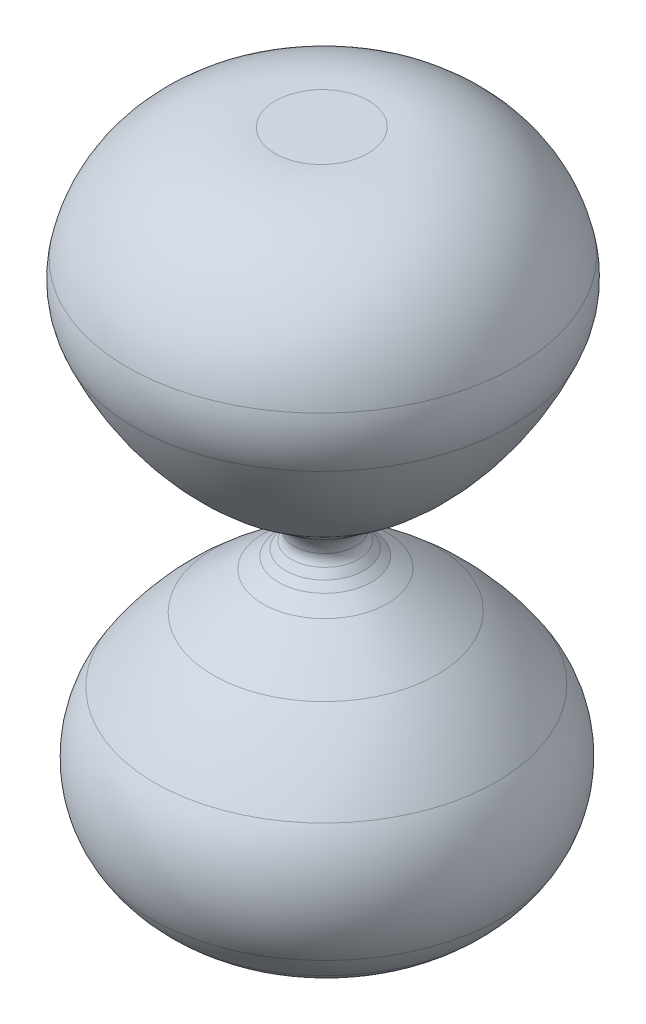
ISO-10303-21;
HEADER;
FILE_DESCRIPTION(('STEP AP214'),'2;1');
FILE_NAME('part.step','',(''),(''),'','','');
FILE_SCHEMA(('AUTOMOTIVE_DESIGN { 1 0 10303 214 1 1 1 1 }'));
ENDSEC;
DATA;
#1=APPLICATION_CONTEXT('core data for automotive mechanical design processes');
#2=APPLICATION_PROTOCOL_DEFINITION('international standard','automotive_design',2000,#1);
#3=PRODUCT_CONTEXT('',#1,'mechanical');
#4=PRODUCT('Part','Part','',(#3));
#5=PRODUCT_RELATED_PRODUCT_CATEGORY('part','',(#4));
#6=PRODUCT_DEFINITION_FORMATION('','',#4);
#7=PRODUCT_DEFINITION_CONTEXT('part definition',#1,'design');
#8=PRODUCT_DEFINITION('design','',#6,#7);
#9=PRODUCT_DEFINITION_SHAPE('','',#8);
#10=(LENGTH_UNIT() NAMED_UNIT(*) SI_UNIT(.MILLI.,.METRE.));
#11=(NAMED_UNIT(*) PLANE_ANGLE_UNIT() SI_UNIT($,.RADIAN.));
#12=(NAMED_UNIT(*) SI_UNIT($,.STERADIAN.) SOLID_ANGLE_UNIT());
#13=UNCERTAINTY_MEASURE_WITH_UNIT(LENGTH_MEASURE(1.E-05),#10,'distance_accuracy_value','');
#14=(GEOMETRIC_REPRESENTATION_CONTEXT(3) GLOBAL_UNCERTAINTY_ASSIGNED_CONTEXT((#13)) GLOBAL_UNIT_ASSIGNED_CONTEXT((#10,
#11,#12)) REPRESENTATION_CONTEXT('',''));
#15=CARTESIAN_POINT('',(0.,0.,0.));
#16=DIRECTION('',(0.,0.,1.));
#17=DIRECTION('',(1.,0.,0.));
#18=AXIS2_PLACEMENT_3D('',#15,#16,#17);
#19=CARTESIAN_POINT('',(0.254643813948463,94.7935693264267,0.));
#20=DIRECTION('',(-0.00939949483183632,0.999955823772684,0.));
#21=DIRECTION('',(-0.999955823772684,-0.00939949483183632,0.));
#22=AXIS2_PLACEMENT_3D('',#19,#20,#21);
#23=DEGENERATE_TOROIDAL_SURFACE('',#22,10.5104678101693,26.5079333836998,.T.);
#24=CARTESIAN_POINT('',(0.00604862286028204,121.24011922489,0.));
#25=DIRECTION('',(-0.00939949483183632,0.999955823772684,0.));
#26=DIRECTION('',(-0.999955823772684,-0.00939949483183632,0.));
#27=AXIS2_PLACEMENT_3D('',#24,#25,#26);
#28=CIRCLE('',#27,8.72476593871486);
#29=CARTESIAN_POINT('',(-8.71833188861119,121.15811083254,0.));
#30=VERTEX_POINT('',#29);
#31=EDGE_CURVE('E52',#30,#30,#28,.T.);
#32=ORIENTED_EDGE('',*,*,#31,.F.);
#33=EDGE_LOOP('',(#32));
#34=FACE_BOUND('',#33,.T.);
#35=CARTESIAN_POINT('',(0.203753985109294,100.207432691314,0.));
#36=DIRECTION('',(-0.00939949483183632,0.999955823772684,0.));
#37=DIRECTION('',(-0.999955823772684,-0.00939949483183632,0.));
#38=AXIS2_PLACEMENT_3D('',#35,#36,#37);
#39=CIRCLE('',#38,36.4596108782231);
#40=CARTESIAN_POINT('',(-36.2542462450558,99.8647307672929,0.));
#41=VERTEX_POINT('',#40);
#42=EDGE_CURVE('E11',#41,#41,#39,.T.);
#43=ORIENTED_EDGE('',*,*,#42,.T.);
#44=EDGE_LOOP('',(#43));
#45=FACE_BOUND('',#44,.T.);
#46=ADVANCED_FACE('F32',(#34,#45),#23,.T.);
#47=CARTESIAN_POINT('',(0.236149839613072,96.7610322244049,0.));
#48=DIRECTION('',(-0.00939949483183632,0.999955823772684,0.));
#49=DIRECTION('',(-0.999955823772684,-0.00939949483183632,0.));
#50=AXIS2_PLACEMENT_3D('',#47,#48,#49);
#51=TOROIDAL_SURFACE('',#50,19.9406977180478,16.8746323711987);
#52=ORIENTED_EDGE('',*,*,#42,.F.);
#53=EDGE_LOOP('',(#52));
#54=FACE_BOUND('',#53,.T.);
#55=CARTESIAN_POINT('',(0.299410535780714,90.0311065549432,0.));
#56=DIRECTION('',(-0.00939949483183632,0.999955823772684,0.));
#57=DIRECTION('',(-0.999955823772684,-0.00939949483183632,0.));
#58=AXIS2_PLACEMENT_3D('',#55,#56,#57);
#59=CIRCLE('',#58,35.415106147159);
#60=CARTESIAN_POINT('',(-35.1141311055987,89.698222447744,0.));
#61=VERTEX_POINT('',#60);
#62=EDGE_CURVE('E39',#61,#61,#59,.T.);
#63=ORIENTED_EDGE('',*,*,#62,.T.);
#64=EDGE_LOOP('',(#63));
#65=FACE_BOUND('',#64,.T.);
#66=ADVANCED_FACE('F97',(#54,#65),#51,.T.);
#67=CARTESIAN_POINT('',(0.0735629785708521,114.057672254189,0.));
#68=DIRECTION('',(-0.00939949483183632,0.999955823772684,0.));
#69=DIRECTION('',(-0.999955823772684,-0.00939949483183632,0.));
#70=AXIS2_PLACEMENT_3D('',#67,#68,#69);
#71=DEGENERATE_TOROIDAL_SURFACE('',#70,19.8302129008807,60.244270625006,.F.);
#72=ORIENTED_EDGE('',*,*,#62,.F.);
#73=EDGE_LOOP('',(#72));
#74=FACE_BOUND('',#73,.T.);
#75=CARTESIAN_POINT('',(0.509248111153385,67.7077467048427,0.));
#76=DIRECTION('',(-0.00939949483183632,0.999955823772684,0.));
#77=DIRECTION('',(-0.999955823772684,-0.00939949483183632,0.));
#78=AXIS2_PLACEMENT_3D('',#75,#76,#77);
#79=CIRCLE('',#78,18.6518182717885);
#80=CARTESIAN_POINT('',(-18.1417461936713,67.5324290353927,0.));
#81=VERTEX_POINT('',#80);
#82=EDGE_CURVE('E92',#81,#81,#79,.T.);
#83=ORIENTED_EDGE('',*,*,#82,.T.);
#84=EDGE_LOOP('',(#83));
#85=FACE_BOUND('',#84,.T.);
#86=ADVANCED_FACE('F99',(#74,#85),#71,.F.);
#87=CARTESIAN_POINT('',(0.582390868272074,59.9265278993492,0.));
#88=DIRECTION('',(-0.00939949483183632,0.999955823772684,0.));
#89=DIRECTION('',(-0.999955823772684,-0.00939949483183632,0.));
#90=AXIS2_PLACEMENT_3D('',#87,#88,#89);
#91=CONICAL_SURFACE('',#90,8.1483982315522,0.933170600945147);
#92=ORIENTED_EDGE('',*,*,#82,.F.);
#93=EDGE_LOOP('',(#92));
#94=FACE_BOUND('',#93,.T.);
#95=CARTESIAN_POINT('',(0.582390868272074,59.9265278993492,0.));
#96=DIRECTION('',(-0.00939949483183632,0.999955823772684,0.));
#97=DIRECTION('',(-0.999955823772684,-0.00939949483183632,0.));
#98=AXIS2_PLACEMENT_3D('',#95,#96,#97);
#99=CIRCLE('',#98,8.1483982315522);
#100=CARTESIAN_POINT('',(-7.56564739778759,59.849937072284,0.));
#101=VERTEX_POINT('',#100);
#102=EDGE_CURVE('E89',#101,#101,#99,.T.);
#103=ORIENTED_EDGE('',*,*,#102,.T.);
#104=EDGE_LOOP('',(#103));
#105=FACE_BOUND('',#104,.T.);
#106=ADVANCED_FACE('F102',(#94,#105),#91,.T.);
#107=CARTESIAN_POINT('',(0.627687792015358,55.107660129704,0.));
#108=DIRECTION('',(-0.00939949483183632,0.999955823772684,0.));
#109=DIRECTION('',(-0.999955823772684,-0.00939949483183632,0.));
#110=AXIS2_PLACEMENT_3D('',#107,#108,#109);
#111=TOROIDAL_SURFACE('',#110,11.7186617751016,5.99752617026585);
#112=ORIENTED_EDGE('',*,*,#102,.F.);
#113=EDGE_LOOP('',(#112));
#114=FACE_BOUND('',#113,.T.);
#115=CARTESIAN_POINT('',(0.618887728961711,56.0438460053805,0.));
#116=DIRECTION('',(-0.00939949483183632,0.999955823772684,0.));
#117=DIRECTION('',(-0.999955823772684,-0.00939949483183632,0.));
#118=AXIS2_PLACEMENT_3D('',#115,#116,#117);
#119=CIRCLE('',#118,5.79465985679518);
#120=CARTESIAN_POINT('',(-5.17551614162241,55.9893791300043,0.));
#121=VERTEX_POINT('',#120);
#122=EDGE_CURVE('E86',#121,#121,#119,.T.);
#123=ORIENTED_EDGE('',*,*,#122,.T.);
#124=EDGE_LOOP('',(#123));
#125=FACE_BOUND('',#124,.T.);
#126=ADVANCED_FACE('F108',(#114,#125),#111,.F.);
#127=CARTESIAN_POINT('',(0.62244029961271,55.665909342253,0.));
#128=DIRECTION('',(-0.00939949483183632,0.999955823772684,0.));
#129=DIRECTION('',(-0.999955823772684,-0.00939949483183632,0.));
#130=AXIS2_PLACEMENT_3D('',#127,#128,#129);
#131=TOROIDAL_SURFACE('',#130,8.18616946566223,2.42119122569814);
#132=ORIENTED_EDGE('',*,*,#122,.F.);
#133=EDGE_LOOP('',(#132));
#134=FACE_BOUND('',#133,.T.);
#135=CARTESIAN_POINT('',(0.636671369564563,54.1519512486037,0.));
#136=DIRECTION('',(-0.00939949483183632,0.999955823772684,0.));
#137=DIRECTION('',(-0.999955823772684,-0.00939949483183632,0.));
#138=AXIS2_PLACEMENT_3D('',#135,#136,#137);
#139=CIRCLE('',#138,6.29675280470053);
#140=CARTESIAN_POINT('',(-5.65980326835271,54.0927649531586,0.));
#141=VERTEX_POINT('',#140);
#142=EDGE_CURVE('E83',#141,#141,#139,.T.);
#143=ORIENTED_EDGE('',*,*,#142,.T.);
#144=EDGE_LOOP('',(#143));
#145=FACE_BOUND('',#144,.T.);
#146=ADVANCED_FACE('F114',(#134,#145),#131,.F.);
#147=CARTESIAN_POINT('',(0.649152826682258,52.8241239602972,0.));
#148=DIRECTION('',(0.00939949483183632,-0.999955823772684,0.));
#149=DIRECTION('',(0.999955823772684,0.00939949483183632,0.));
#150=AXIS2_PLACEMENT_3D('',#147,#148,#149);
#151=CONICAL_SURFACE('',#150,7.36081270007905,0.67554453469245);
#152=ORIENTED_EDGE('',*,*,#142,.F.);
#153=EDGE_LOOP('',(#152));
#154=FACE_BOUND('',#153,.T.);
#155=CARTESIAN_POINT('',(0.649152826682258,52.8241239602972,0.));
#156=DIRECTION('',(-0.00939949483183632,0.999955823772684,0.));
#157=DIRECTION('',(-0.999955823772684,-0.00939949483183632,0.));
#158=AXIS2_PLACEMENT_3D('',#155,#156,#157);
#159=CIRCLE('',#158,7.36081270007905);
#160=CARTESIAN_POINT('',(-6.71133470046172,52.7549360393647,0.));
#161=VERTEX_POINT('',#160);
#162=EDGE_CURVE('E80',#161,#161,#159,.T.);
#163=ORIENTED_EDGE('',*,*,#162,.T.);
#164=EDGE_LOOP('',(#163));
#165=FACE_BOUND('',#164,.T.);
#166=ADVANCED_FACE('F120',(#154,#165),#151,.T.);
#167=CARTESIAN_POINT('',(0.660543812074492,51.6123054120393,0.));
#168=DIRECTION('',(0.00939949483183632,-0.999955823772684,0.));
#169=DIRECTION('',(0.999955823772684,0.00939949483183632,0.));
#170=AXIS2_PLACEMENT_3D('',#167,#168,#169);
#171=CONICAL_SURFACE('',#170,8.71342373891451,0.840223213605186);
#172=ORIENTED_EDGE('',*,*,#162,.F.);
#173=EDGE_LOOP('',(#172));
#174=FACE_BOUND('',#173,.T.);
#175=CARTESIAN_POINT('',(0.660543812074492,51.6123054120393,0.));
#176=DIRECTION('',(-0.00939949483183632,0.999955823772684,0.));
#177=DIRECTION('',(-0.999955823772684,-0.00939949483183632,0.));
#178=AXIS2_PLACEMENT_3D('',#175,#176,#177);
#179=CIRCLE('',#178,8.71342373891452);
#180=CARTESIAN_POINT('',(-8.05249500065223,51.5304036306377,0.));
#181=VERTEX_POINT('',#180);
#182=EDGE_CURVE('E77',#181,#181,#179,.T.);
#183=ORIENTED_EDGE('',*,*,#182,.T.);
#184=EDGE_LOOP('',(#183));
#185=FACE_BOUND('',#184,.T.);
#186=ADVANCED_FACE('F126',(#174,#185),#171,.T.);
#187=CARTESIAN_POINT('',(0.679788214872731,49.5650089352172,0.));
#188=DIRECTION('',(0.00939949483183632,-0.999955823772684,0.));
#189=DIRECTION('',(0.999955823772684,0.00939949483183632,0.));
#190=AXIS2_PLACEMENT_3D('',#187,#188,#189);
#191=CONICAL_SURFACE('',#190,11.6665590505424,0.96458615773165);
#192=ORIENTED_EDGE('',*,*,#182,.F.);
#193=EDGE_LOOP('',(#192));
#194=FACE_BOUND('',#193,.T.);
#195=CARTESIAN_POINT('',(0.679788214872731,49.5650089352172,0.));
#196=DIRECTION('',(-0.00939949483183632,0.999955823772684,0.));
#197=DIRECTION('',(-0.999955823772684,-0.00939949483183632,0.));
#198=AXIS2_PLACEMENT_3D('',#195,#196,#197);
#199=CIRCLE('',#198,11.6665590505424);
#200=CARTESIAN_POINT('',(-10.986255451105,49.4553491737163,0.));
#201=VERTEX_POINT('',#200);
#202=EDGE_CURVE('E74',#201,#201,#199,.T.);
#203=ORIENTED_EDGE('',*,*,#202,.T.);
#204=EDGE_LOOP('',(#203));
#205=FACE_BOUND('',#204,.T.);
#206=ADVANCED_FACE('F132',(#194,#205),#191,.T.);
#207=CARTESIAN_POINT('',(1.93451198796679,-83.9175203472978,0.));
#208=DIRECTION('',(-0.00939949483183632,0.999955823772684,0.));
#209=DIRECTION('',(-0.999955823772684,-0.00939949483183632,0.));
#210=AXIS2_PLACEMENT_3D('',#207,#208,#209);
#211=DEGENERATE_TOROIDAL_SURFACE('',#210,80.8799819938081,162.431592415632,.F.);
#212=ORIENTED_EDGE('',*,*,#202,.F.);
#213=EDGE_LOOP('',(#212));
#214=FACE_BOUND('',#213,.T.);
#215=CARTESIAN_POINT('',(0.7453185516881,42.5936298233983,0.));
#216=DIRECTION('',(-0.00939949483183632,0.999955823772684,0.));
#217=DIRECTION('',(-0.999955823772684,-0.00939949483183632,0.));
#218=AXIS2_PLACEMENT_3D('',#215,#216,#217);
#219=CIRCLE('',#218,20.9902144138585);
#220=CARTESIAN_POINT('',(-20.2439685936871,42.3963324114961,0.));
#221=VERTEX_POINT('',#220);
#222=EDGE_CURVE('E71',#221,#221,#219,.T.);
#223=ORIENTED_EDGE('',*,*,#222,.T.);
#224=EDGE_LOOP('',(#223));
#225=FACE_BOUND('',#224,.T.);
#226=ADVANCED_FACE('F138',(#214,#225),#211,.F.);
#227=CARTESIAN_POINT('',(1.1452495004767,0.0473772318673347,0.));
#228=DIRECTION('',(-0.00939949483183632,0.999955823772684,0.));
#229=DIRECTION('',(-0.999955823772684,-0.00939949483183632,0.));
#230=AXIS2_PLACEMENT_3D('',#227,#228,#229);
#231=DEGENERATE_TOROIDAL_SURFACE('',#230,13.26917775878,54.6264542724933,.F.);
#232=ORIENTED_EDGE('',*,*,#222,.F.);
#233=EDGE_LOOP('',(#232));
#234=FACE_BOUND('',#233,.T.);
#235=CARTESIAN_POINT('',(0.858281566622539,30.5761728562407,0.));
#236=DIRECTION('',(-0.00939949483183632,0.999955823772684,0.));
#237=DIRECTION('',(-0.999955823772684,-0.00939949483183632,0.));
#238=AXIS2_PLACEMENT_3D('',#235,#236,#237);
#239=CIRCLE('',#238,32.0293850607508);
#240=CARTESIAN_POINT('',(-31.169688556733,30.2751128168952,0.));
#241=VERTEX_POINT('',#240);
#242=EDGE_CURVE('E68',#241,#241,#239,.T.);
#243=ORIENTED_EDGE('',*,*,#242,.T.);
#244=EDGE_LOOP('',(#243));
#245=FACE_BOUND('',#244,.T.);
#246=ADVANCED_FACE('F144',(#234,#245),#231,.F.);
#247=CARTESIAN_POINT('',(0.966489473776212,19.0645832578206,0.));
#248=DIRECTION('',(-0.00939949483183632,0.999955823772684,0.));
#249=DIRECTION('',(-0.999955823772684,-0.00939949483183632,0.));
#250=AXIS2_PLACEMENT_3D('',#247,#248,#249);
#251=DEGENERATE_TOROIDAL_SURFACE('',#250,14.9485125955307,20.5981700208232,.T.);
#252=ORIENTED_EDGE('',*,*,#242,.F.);
#253=EDGE_LOOP('',(#252));
#254=FACE_BOUND('',#253,.T.);
#255=CARTESIAN_POINT('',(1.06291986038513,8.80593336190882,0.));
#256=DIRECTION('',(-0.00939949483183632,0.999955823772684,0.));
#257=DIRECTION('',(-0.999955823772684,-0.00939949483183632,0.));
#258=AXIS2_PLACEMENT_3D('',#255,#256,#257);
#259=CIRCLE('',#258,32.8100750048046);
#260=CARTESIAN_POINT('',(-31.7457057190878,8.497535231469,0.));
#261=VERTEX_POINT('',#260);
#262=EDGE_CURVE('E65',#261,#261,#259,.T.);
#263=ORIENTED_EDGE('',*,*,#262,.T.);
#264=EDGE_LOOP('',(#263));
#265=FACE_BOUND('',#264,.T.);
#266=ADVANCED_FACE('F150',(#254,#265),#251,.T.);
#267=CARTESIAN_POINT('',(0.950138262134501,20.8040904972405,0.));
#268=DIRECTION('',(-0.00939949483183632,0.999955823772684,0.));
#269=DIRECTION('',(-0.999955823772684,-0.00939949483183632,0.));
#270=AXIS2_PLACEMENT_3D('',#267,#268,#269);
#271=DEGENERATE_TOROIDAL_SURFACE('',#270,11.9198180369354,24.0908972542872,.T.);
#272=ORIENTED_EDGE('',*,*,#262,.F.);
#273=EDGE_LOOP('',(#272));
#274=FACE_BOUND('',#273,.T.);
#275=CARTESIAN_POINT('',(1.11372042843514,3.40156591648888,0.));
#276=DIRECTION('',(-0.00939949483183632,0.999955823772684,0.));
#277=DIRECTION('',(-0.999955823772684,-0.00939949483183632,0.));
#278=AXIS2_PLACEMENT_3D('',#275,#276,#277);
#279=CIRCLE('',#278,28.5780505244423);
#280=CARTESIAN_POINT('',(-27.4630676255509,3.13294667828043,0.));
#281=VERTEX_POINT('',#280);
#282=EDGE_CURVE('E62',#281,#281,#279,.T.);
#283=ORIENTED_EDGE('',*,*,#282,.T.);
#284=EDGE_LOOP('',(#283));
#285=FACE_BOUND('',#284,.T.);
#286=ADVANCED_FACE('F156',(#274,#285),#271,.T.);
#287=CARTESIAN_POINT('',(0.92858265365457,23.0972622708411,0.));
#288=DIRECTION('',(-0.00939949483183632,0.999955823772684,0.));
#289=DIRECTION('',(-0.999955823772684,-0.00939949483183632,0.));
#290=AXIS2_PLACEMENT_3D('',#287,#288,#289);
#291=DEGENERATE_TOROIDAL_SURFACE('',#290,9.72472339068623,27.265411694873,.T.);
#292=ORIENTED_EDGE('',*,*,#282,.F.);
#293=EDGE_LOOP('',(#292));
#294=FACE_BOUND('',#293,.T.);
#295=CARTESIAN_POINT('',(1.15996135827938,-1.51772899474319,0.));
#296=DIRECTION('',(-0.00939949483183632,0.999955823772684,0.));
#297=DIRECTION('',(-0.999955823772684,-0.00939949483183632,0.));
#298=AXIS2_PLACEMENT_3D('',#295,#296,#297);
#299=CIRCLE('',#298,21.4486878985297);
#300=CARTESIAN_POINT('',(-20.287779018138,-1.71933582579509,0.));
#301=VERTEX_POINT('',#300);
#302=EDGE_CURVE('E57',#301,#301,#299,.T.);
#303=ORIENTED_EDGE('',*,*,#302,.T.);
#304=EDGE_LOOP('',(#303));
#305=FACE_BOUND('',#304,.T.);
#306=ADVANCED_FACE('F162',(#294,#305),#291,.T.);
#307=CARTESIAN_POINT('',(1.0729715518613,7.73659425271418,0.));
#308=DIRECTION('',(-0.00939949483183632,0.999955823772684,0.));
#309=DIRECTION('',(-0.999955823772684,-0.00939949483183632,0.));
#310=AXIS2_PLACEMENT_3D('',#307,#308,#309);
#311=TOROIDAL_SURFACE('',#310,17.0409123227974,10.2507829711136);
#312=ORIENTED_EDGE('',*,*,#302,.F.);
#313=EDGE_LOOP('',(#312));
#314=FACE_BOUND('',#313,.T.);
#315=CARTESIAN_POINT('',(1.1673292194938,-2.30155151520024,0.));
#316=DIRECTION('',(-0.00939949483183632,0.999955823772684,0.));
#317=DIRECTION('',(-0.999955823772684,-0.00939949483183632,0.));
#318=AXIS2_PLACEMENT_3D('',#315,#316,#317);
#319=CIRCLE('',#318,19.1158286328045);
#320=CARTESIAN_POINT('',(-17.9476549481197,-2.48123064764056,0.));
#321=VERTEX_POINT('',#320);
#322=EDGE_CURVE('E54',#321,#321,#319,.T.);
#323=ORIENTED_EDGE('',*,*,#322,.T.);
#324=EDGE_LOOP('',(#323));
#325=FACE_BOUND('',#324,.T.);
#326=ADVANCED_FACE('F168',(#314,#325),#311,.T.);
#327=CARTESIAN_POINT('',(1.16564025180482,-2.12187238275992,0.));
#328=DIRECTION('',(0.00939949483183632,-0.999955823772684,0.));
#329=DIRECTION('',(0.999955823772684,0.00939949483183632,0.));
#330=AXIS2_PLACEMENT_3D('',#327,#328,#329);
#331=CONICAL_SURFACE('',#330,0.,1.56139669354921);
#332=ORIENTED_EDGE('',*,*,#322,.F.);
#333=EDGE_LOOP('',(#332));
#334=FACE_BOUND('',#333,.T.);
#335=CARTESIAN_POINT('',(1.16564025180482,-2.12187238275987,0.));
#336=VERTEX_POINT('',#335);
#337=VERTEX_LOOP('',#336);
#338=FACE_BOUND('',#337,.T.);
#339=ADVANCED_FACE('F48',(#334,#338),#331,.F.);
#340=CARTESIAN_POINT('',(0.00604862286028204,121.24011922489,0.));
#341=DIRECTION('',(0.00939949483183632,-0.999955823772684,0.));
#342=DIRECTION('',(0.999955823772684,0.00939949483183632,0.));
#343=AXIS2_PLACEMENT_3D('',#340,#341,#342);
#344=CONICAL_SURFACE('',#343,8.72476593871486,1.56139669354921);
#345=CARTESIAN_POINT('',(0.00527775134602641,121.32212761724,0.));
#346=VERTEX_POINT('',#345);
#347=VERTEX_LOOP('',#346);
#348=FACE_BOUND('',#347,.T.);
#349=ORIENTED_EDGE('',*,*,#31,.T.);
#350=EDGE_LOOP('',(#349));
#351=FACE_BOUND('',#350,.T.);
#352=ADVANCED_FACE('F45',(#348,#351),#344,.T.);
#353=CLOSED_SHELL('',(#46,#66,#86,#106,#126,#146,#166,#186,#206,#226,#246,#266,#286,#306,#326,
#339,#352));
#354=MANIFOLD_SOLID_BREP('B2',#353);
#355=ADVANCED_BREP_SHAPE_REPRESENTATION('',(#18,#354),#14);
#356=SHAPE_DEFINITION_REPRESENTATION(#9,#355);
ENDSEC;
END-ISO-10303-21;
